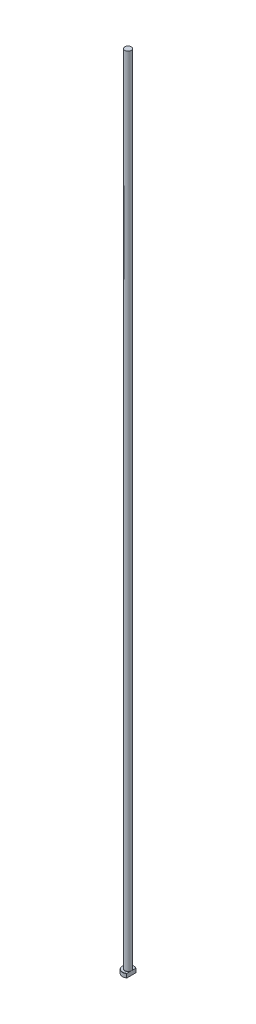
from build123d import *
from build123d.topology import SkipClean

# Parameters (mm, degrees)
CHAMFER1_SIZE = 0.2
FILLET1_R     = 0.2
KEY_DEPTH     = 1001.0489988


with BuildPart() as part:
    # Sketch1 → Revolve1 (revolve)
    with BuildSketch(Plane.XY, mode=Mode.PRIVATE) as revolve1_sk:
        Polygon((0, 0), (-7, 0), (-7, 5), (-4, 5), (-4, 1000), (0, 1000), align=None)
    revolve(revolve1_sk.sketch.rotate(Axis((0, 259.958771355, 0), (0, -1, 0)), 270), axis=Axis((0, 259.958771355, 0), (0, -1, 0)))

    # Chamfer1
    chamfer1_edges = [part.edges().sort_by_distance(p)[0] for p in [
        (0, 5, -7),
        (0, 0, -7),
    ]]
    chamfer(chamfer1_edges, length=CHAMFER1_SIZE)

    # Fillet1
    fillet1_edges = [part.edges().sort_by_distance(p)[0] for p in [
        (0, 5, -4),
    ]]
    fillet(fillet1_edges, radius=FILLET1_R)

    # Sketch2 → KEY (cut, through all)
    with SkipClean():  # the faces are left unmerged after this step: merging them gives an invalid solid
        with BuildSketch(Plane(origin=(0, 0, 0), x_dir=(1, 0, 0), z_dir=(0, 1, 0))):
            with BuildLine():
                Line((4, 5.744562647), (4, -5.744562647))
                ThreePointArc((4, -5.744562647), (7, 0), (4, 5.744562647))
            make_face()
        extrude(amount=KEY_DEPTH, mode=Mode.SUBTRACT)


solid = part.part
